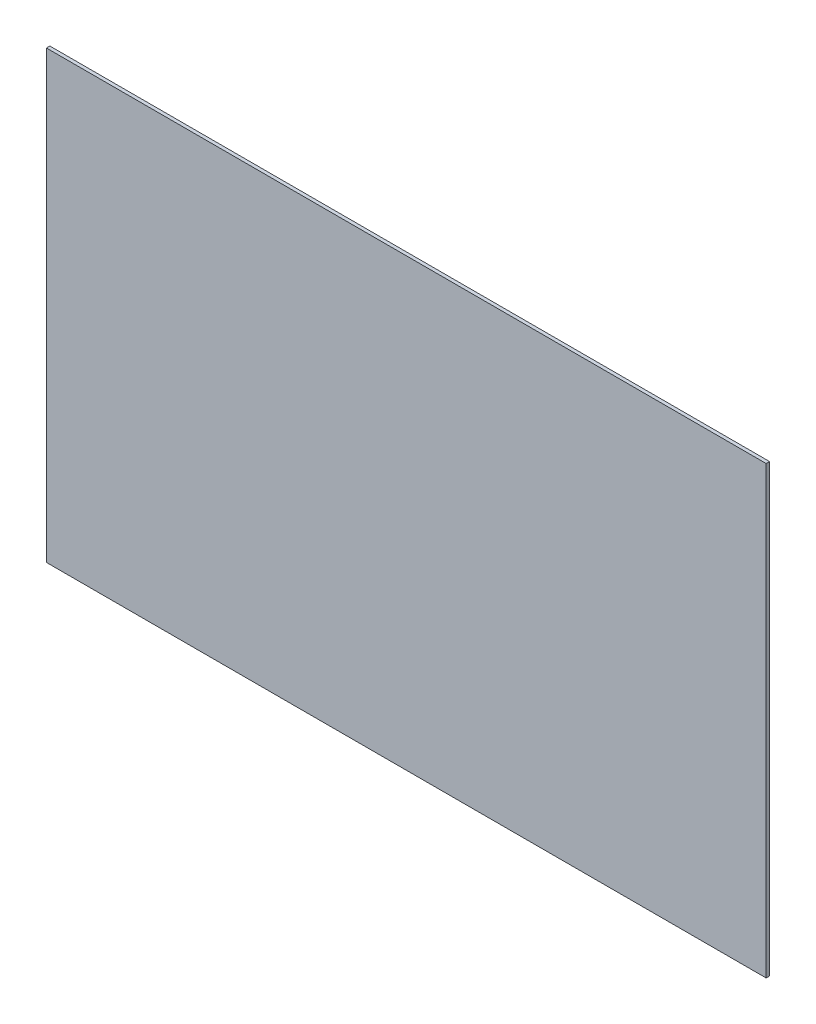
ISO-10303-21;
HEADER;
FILE_DESCRIPTION(('STEP AP214'),'2;1');
FILE_NAME('part.step','',(''),(''),'','','');
FILE_SCHEMA(('AUTOMOTIVE_DESIGN { 1 0 10303 214 1 1 1 1 }'));
ENDSEC;
DATA;
#1=APPLICATION_CONTEXT('core data for automotive mechanical design processes');
#2=APPLICATION_PROTOCOL_DEFINITION('international standard','automotive_design',2000,#1);
#3=PRODUCT_CONTEXT('',#1,'mechanical');
#4=PRODUCT('Part','Part','',(#3));
#5=PRODUCT_RELATED_PRODUCT_CATEGORY('part','',(#4));
#6=PRODUCT_DEFINITION_FORMATION('','',#4);
#7=PRODUCT_DEFINITION_CONTEXT('part definition',#1,'design');
#8=PRODUCT_DEFINITION('design','',#6,#7);
#9=PRODUCT_DEFINITION_SHAPE('','',#8);
#10=(LENGTH_UNIT() NAMED_UNIT(*) SI_UNIT(.MILLI.,.METRE.));
#11=(NAMED_UNIT(*) PLANE_ANGLE_UNIT() SI_UNIT($,.RADIAN.));
#12=(NAMED_UNIT(*) SI_UNIT($,.STERADIAN.) SOLID_ANGLE_UNIT());
#13=UNCERTAINTY_MEASURE_WITH_UNIT(LENGTH_MEASURE(1.E-05),#10,'distance_accuracy_value','');
#14=(GEOMETRIC_REPRESENTATION_CONTEXT(3) GLOBAL_UNCERTAINTY_ASSIGNED_CONTEXT((#13)) GLOBAL_UNIT_ASSIGNED_CONTEXT((#10,
#11,#12)) REPRESENTATION_CONTEXT('',''));
#15=CARTESIAN_POINT('',(0.,0.,0.));
#16=DIRECTION('',(0.,0.,1.));
#17=DIRECTION('',(1.,0.,0.));
#18=AXIS2_PLACEMENT_3D('',#15,#16,#17);
#19=CARTESIAN_POINT('',(0.,0.,0.2));
#20=DIRECTION('',(0.,0.,-1.));
#21=DIRECTION('',(-1.,0.,0.));
#22=AXIS2_PLACEMENT_3D('',#19,#20,#21);
#23=PLANE('',#22);
#24=DIRECTION('',(0.,1.,0.));
#25=VECTOR('',#24,1.);
#26=CARTESIAN_POINT('',(22.5,12.,0.2));
#27=LINE('',#26,#25);
#28=CARTESIAN_POINT('',(22.5,12.,0.2));
#29=VERTEX_POINT('',#28);
#30=CARTESIAN_POINT('',(22.5,38.,0.2));
#31=VERTEX_POINT('',#30);
#32=EDGE_CURVE('E54',#29,#31,#27,.T.);
#33=ORIENTED_EDGE('',*,*,#32,.F.);
#34=DIRECTION('',(1.,0.,0.));
#35=VECTOR('',#34,1.);
#36=CARTESIAN_POINT('',(64.5,12.,0.2));
#37=LINE('',#36,#35);
#38=CARTESIAN_POINT('',(64.5,12.,0.2));
#39=VERTEX_POINT('',#38);
#40=EDGE_CURVE('E19',#39,#29,#37,.F.);
#41=ORIENTED_EDGE('',*,*,#40,.F.);
#42=DIRECTION('',(0.,1.,0.));
#43=VECTOR('',#42,1.);
#44=CARTESIAN_POINT('',(64.5,38.,0.2));
#45=LINE('',#44,#43);
#46=CARTESIAN_POINT('',(64.5,38.,0.2));
#47=VERTEX_POINT('',#46);
#48=EDGE_CURVE('E79',#47,#39,#45,.F.);
#49=ORIENTED_EDGE('',*,*,#48,.F.);
#50=DIRECTION('',(1.,0.,0.));
#51=VECTOR('',#50,1.);
#52=CARTESIAN_POINT('',(22.5,38.,0.2));
#53=LINE('',#52,#51);
#54=EDGE_CURVE('E67',#31,#47,#53,.T.);
#55=ORIENTED_EDGE('',*,*,#54,.F.);
#56=EDGE_LOOP('',(#33,#41,#49,#55));
#57=FACE_BOUND('',#56,.T.);
#58=ADVANCED_FACE('F16',(#57),#23,.F.);
#59=CARTESIAN_POINT('',(64.5,12.,0.));
#60=DIRECTION('',(0.,-1.,0.));
#61=DIRECTION('',(0.,0.,-1.));
#62=AXIS2_PLACEMENT_3D('',#59,#60,#61);
#63=PLANE('',#62);
#64=DIRECTION('',(0.,0.,1.));
#65=VECTOR('',#64,1.);
#66=CARTESIAN_POINT('',(22.5,12.,0.));
#67=LINE('',#66,#65);
#68=CARTESIAN_POINT('',(22.5,12.,0.));
#69=VERTEX_POINT('',#68);
#70=EDGE_CURVE('E60',#69,#29,#67,.T.);
#71=ORIENTED_EDGE('',*,*,#70,.F.);
#72=DIRECTION('',(-1.,0.,0.));
#73=VECTOR('',#72,1.);
#74=CARTESIAN_POINT('',(0.,12.,0.));
#75=LINE('',#74,#73);
#76=CARTESIAN_POINT('',(64.5,12.,0.));
#77=VERTEX_POINT('',#76);
#78=EDGE_CURVE('E82',#77,#69,#75,.T.);
#79=ORIENTED_EDGE('',*,*,#78,.F.);
#80=DIRECTION('',(0.,0.,-1.));
#81=VECTOR('',#80,1.);
#82=CARTESIAN_POINT('',(64.5,12.,0.));
#83=LINE('',#82,#81);
#84=EDGE_CURVE('E63',#39,#77,#83,.T.);
#85=ORIENTED_EDGE('',*,*,#84,.F.);
#86=ORIENTED_EDGE('',*,*,#40,.T.);
#87=EDGE_LOOP('',(#71,#79,#85,#86));
#88=FACE_BOUND('',#87,.T.);
#89=ADVANCED_FACE('F59',(#88),#63,.T.);
#90=CARTESIAN_POINT('',(22.5,12.,0.));
#91=DIRECTION('',(-1.,0.,0.));
#92=DIRECTION('',(0.,0.,1.));
#93=AXIS2_PLACEMENT_3D('',#90,#91,#92);
#94=PLANE('',#93);
#95=DIRECTION('',(0.,0.,1.));
#96=VECTOR('',#95,1.);
#97=CARTESIAN_POINT('',(22.5,38.,0.));
#98=LINE('',#97,#96);
#99=CARTESIAN_POINT('',(22.5,38.,0.));
#100=VERTEX_POINT('',#99);
#101=EDGE_CURVE('E69',#100,#31,#98,.T.);
#102=ORIENTED_EDGE('',*,*,#101,.F.);
#103=DIRECTION('',(0.,1.,0.));
#104=VECTOR('',#103,1.);
#105=CARTESIAN_POINT('',(22.5,0.,0.));
#106=LINE('',#105,#104);
#107=EDGE_CURVE('E73',#69,#100,#106,.T.);
#108=ORIENTED_EDGE('',*,*,#107,.F.);
#109=ORIENTED_EDGE('',*,*,#70,.T.);
#110=ORIENTED_EDGE('',*,*,#32,.T.);
#111=EDGE_LOOP('',(#102,#108,#109,#110));
#112=FACE_BOUND('',#111,.T.);
#113=ADVANCED_FACE('F71',(#112),#94,.T.);
#114=CARTESIAN_POINT('',(22.5,38.,0.));
#115=DIRECTION('',(0.,1.,0.));
#116=DIRECTION('',(0.,0.,1.));
#117=AXIS2_PLACEMENT_3D('',#114,#115,#116);
#118=PLANE('',#117);
#119=DIRECTION('',(0.,0.,-1.));
#120=VECTOR('',#119,1.);
#121=CARTESIAN_POINT('',(64.5,38.,0.));
#122=LINE('',#121,#120);
#123=CARTESIAN_POINT('',(64.5,38.,0.));
#124=VERTEX_POINT('',#123);
#125=EDGE_CURVE('E34',#124,#47,#122,.F.);
#126=ORIENTED_EDGE('',*,*,#125,.F.);
#127=DIRECTION('',(-1.,0.,0.));
#128=VECTOR('',#127,1.);
#129=CARTESIAN_POINT('',(0.,38.,0.));
#130=LINE('',#129,#128);
#131=EDGE_CURVE('E25',#100,#124,#130,.F.);
#132=ORIENTED_EDGE('',*,*,#131,.F.);
#133=ORIENTED_EDGE('',*,*,#101,.T.);
#134=ORIENTED_EDGE('',*,*,#54,.T.);
#135=EDGE_LOOP('',(#126,#132,#133,#134));
#136=FACE_BOUND('',#135,.T.);
#137=ADVANCED_FACE('F88',(#136),#118,.T.);
#138=CARTESIAN_POINT('',(64.5,38.,0.));
#139=DIRECTION('',(1.,0.,0.));
#140=DIRECTION('',(0.,0.,-1.));
#141=AXIS2_PLACEMENT_3D('',#138,#139,#140);
#142=PLANE('',#141);
#143=ORIENTED_EDGE('',*,*,#84,.T.);
#144=DIRECTION('',(0.,1.,0.));
#145=VECTOR('',#144,1.);
#146=CARTESIAN_POINT('',(64.5,0.,0.));
#147=LINE('',#146,#145);
#148=EDGE_CURVE('E11',#124,#77,#147,.F.);
#149=ORIENTED_EDGE('',*,*,#148,.F.);
#150=ORIENTED_EDGE('',*,*,#125,.T.);
#151=ORIENTED_EDGE('',*,*,#48,.T.);
#152=EDGE_LOOP('',(#143,#149,#150,#151));
#153=FACE_BOUND('',#152,.T.);
#154=ADVANCED_FACE('F90',(#153),#142,.T.);
#155=CARTESIAN_POINT('',(0.,0.,0.));
#156=DIRECTION('',(0.,0.,-1.));
#157=DIRECTION('',(-1.,0.,0.));
#158=AXIS2_PLACEMENT_3D('',#155,#156,#157);
#159=PLANE('',#158);
#160=ORIENTED_EDGE('',*,*,#131,.T.);
#161=ORIENTED_EDGE('',*,*,#148,.T.);
#162=ORIENTED_EDGE('',*,*,#78,.T.);
#163=ORIENTED_EDGE('',*,*,#107,.T.);
#164=EDGE_LOOP('',(#160,#161,#162,#163));
#165=FACE_BOUND('',#164,.T.);
#166=ADVANCED_FACE('F87',(#165),#159,.T.);
#167=CLOSED_SHELL('',(#58,#89,#113,#137,#154,#166));
#168=MANIFOLD_SOLID_BREP('B1',#167);
#169=ADVANCED_BREP_SHAPE_REPRESENTATION('',(#18,#168),#14);
#170=SHAPE_DEFINITION_REPRESENTATION(#9,#169);
ENDSEC;
END-ISO-10303-21;
